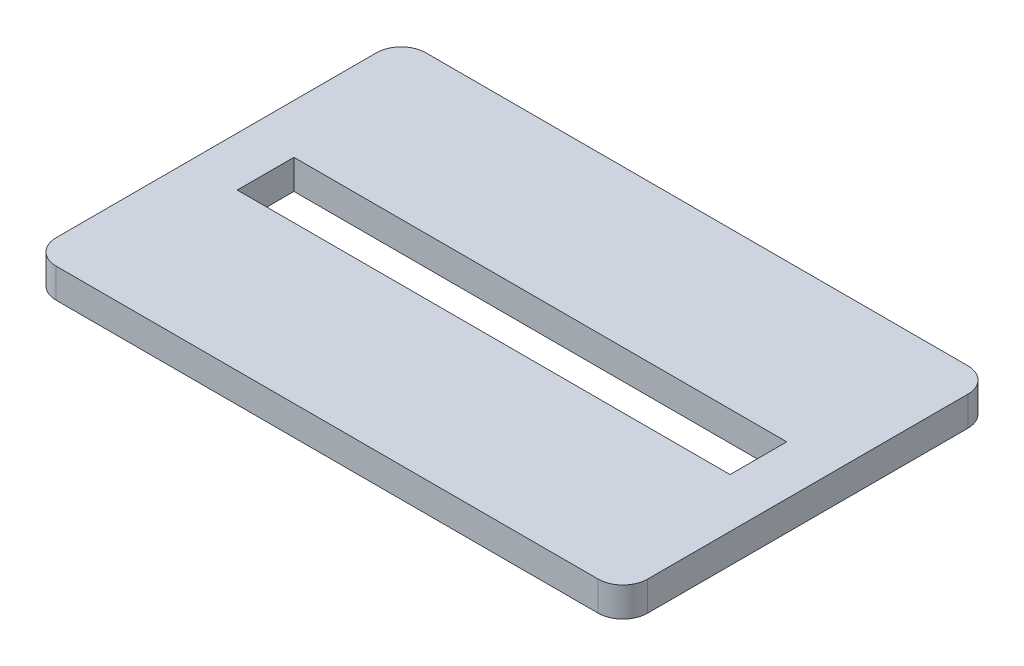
ISO-10303-21;
HEADER;
FILE_DESCRIPTION(('STEP AP214'),'2;1');
FILE_NAME('part.step','',(''),(''),'','','');
FILE_SCHEMA(('AUTOMOTIVE_DESIGN { 1 0 10303 214 1 1 1 1 }'));
ENDSEC;
DATA;
#1=APPLICATION_CONTEXT('core data for automotive mechanical design processes');
#2=APPLICATION_PROTOCOL_DEFINITION('international standard','automotive_design',2000,#1);
#3=PRODUCT_CONTEXT('',#1,'mechanical');
#4=PRODUCT('Part','Part','',(#3));
#5=PRODUCT_RELATED_PRODUCT_CATEGORY('part','',(#4));
#6=PRODUCT_DEFINITION_FORMATION('','',#4);
#7=PRODUCT_DEFINITION_CONTEXT('part definition',#1,'design');
#8=PRODUCT_DEFINITION('design','',#6,#7);
#9=PRODUCT_DEFINITION_SHAPE('','',#8);
#10=(LENGTH_UNIT() NAMED_UNIT(*) SI_UNIT(.MILLI.,.METRE.));
#11=(NAMED_UNIT(*) PLANE_ANGLE_UNIT() SI_UNIT($,.RADIAN.));
#12=(NAMED_UNIT(*) SI_UNIT($,.STERADIAN.) SOLID_ANGLE_UNIT());
#13=UNCERTAINTY_MEASURE_WITH_UNIT(LENGTH_MEASURE(1.E-05),#10,'distance_accuracy_value','');
#14=(GEOMETRIC_REPRESENTATION_CONTEXT(3) GLOBAL_UNCERTAINTY_ASSIGNED_CONTEXT((#13)) GLOBAL_UNIT_ASSIGNED_CONTEXT((#10,
#11,#12)) REPRESENTATION_CONTEXT('',''));
#15=CARTESIAN_POINT('',(0.,0.,0.));
#16=DIRECTION('',(0.,0.,1.));
#17=DIRECTION('',(1.,0.,0.));
#18=AXIS2_PLACEMENT_3D('',#15,#16,#17);
#19=CARTESIAN_POINT('',(0.,6.,0.));
#20=DIRECTION('',(0.,1.,0.));
#21=DIRECTION('',(0.,0.,1.));
#22=AXIS2_PLACEMENT_3D('',#19,#20,#21);
#23=PLANE('',#22);
#24=DIRECTION('',(-1.,0.,0.));
#25=VECTOR('',#24,1.);
#26=CARTESIAN_POINT('',(-60.,6.,-37.5));
#27=LINE('',#26,#25);
#28=CARTESIAN_POINT('',(55.,6.,-37.5));
#29=VERTEX_POINT('',#28);
#30=CARTESIAN_POINT('',(-55.,6.,-37.5));
#31=VERTEX_POINT('',#30);
#32=EDGE_CURVE('E191',#29,#31,#27,.T.);
#33=ORIENTED_EDGE('',*,*,#32,.T.);
#34=CARTESIAN_POINT('',(-55.,6.,-32.5));
#35=DIRECTION('',(0.,1.,0.));
#36=DIRECTION('',(0.,0.,1.));
#37=AXIS2_PLACEMENT_3D('',#34,#35,#36);
#38=CIRCLE('',#37,5.);
#39=CARTESIAN_POINT('',(-60.,6.,-32.5));
#40=VERTEX_POINT('',#39);
#41=EDGE_CURVE('E249',#31,#40,#38,.T.);
#42=ORIENTED_EDGE('',*,*,#41,.T.);
#43=DIRECTION('',(0.,0.,1.));
#44=VECTOR('',#43,1.);
#45=CARTESIAN_POINT('',(-60.,6.,-37.5));
#46=LINE('',#45,#44);
#47=CARTESIAN_POINT('',(-60.,6.,32.5));
#48=VERTEX_POINT('',#47);
#49=EDGE_CURVE('E196',#40,#48,#46,.T.);
#50=ORIENTED_EDGE('',*,*,#49,.T.);
#51=CARTESIAN_POINT('',(-55.,6.,32.5));
#52=DIRECTION('',(0.,1.,0.));
#53=DIRECTION('',(0.,0.,1.));
#54=AXIS2_PLACEMENT_3D('',#51,#52,#53);
#55=CIRCLE('',#54,5.);
#56=CARTESIAN_POINT('',(-55.,6.,37.5));
#57=VERTEX_POINT('',#56);
#58=EDGE_CURVE('E64',#48,#57,#55,.T.);
#59=ORIENTED_EDGE('',*,*,#58,.T.);
#60=DIRECTION('',(1.,0.,0.));
#61=VECTOR('',#60,1.);
#62=CARTESIAN_POINT('',(-60.,6.,37.5));
#63=LINE('',#62,#61);
#64=CARTESIAN_POINT('',(55.,6.,37.5));
#65=VERTEX_POINT('',#64);
#66=EDGE_CURVE('E199',#57,#65,#63,.T.);
#67=ORIENTED_EDGE('',*,*,#66,.T.);
#68=CARTESIAN_POINT('',(55.,6.,32.5));
#69=DIRECTION('',(0.,1.,0.));
#70=DIRECTION('',(0.,0.,1.));
#71=AXIS2_PLACEMENT_3D('',#68,#69,#70);
#72=CIRCLE('',#71,5.);
#73=CARTESIAN_POINT('',(60.,6.,32.5));
#74=VERTEX_POINT('',#73);
#75=EDGE_CURVE('E243',#65,#74,#72,.T.);
#76=ORIENTED_EDGE('',*,*,#75,.T.);
#77=DIRECTION('',(0.,0.,-1.));
#78=VECTOR('',#77,1.);
#79=CARTESIAN_POINT('',(60.,6.,-37.5));
#80=LINE('',#79,#78);
#81=CARTESIAN_POINT('',(60.,6.,-32.5));
#82=VERTEX_POINT('',#81);
#83=EDGE_CURVE('E187',#74,#82,#80,.T.);
#84=ORIENTED_EDGE('',*,*,#83,.T.);
#85=CARTESIAN_POINT('',(55.,6.,-32.5));
#86=DIRECTION('',(0.,1.,0.));
#87=DIRECTION('',(0.,0.,1.));
#88=AXIS2_PLACEMENT_3D('',#85,#86,#87);
#89=CIRCLE('',#88,5.);
#90=EDGE_CURVE('E246',#82,#29,#89,.T.);
#91=ORIENTED_EDGE('',*,*,#90,.T.);
#92=EDGE_LOOP('',(#33,#42,#50,#59,#67,#76,#84,#91));
#93=FACE_BOUND('',#92,.T.);
#94=DIRECTION('',(-1.,0.,0.));
#95=VECTOR('',#94,1.);
#96=CARTESIAN_POINT('',(-50.,6.,-5.75000000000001));
#97=LINE('',#96,#95);
#98=CARTESIAN_POINT('',(50.,6.,-5.75000000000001));
#99=VERTEX_POINT('',#98);
#100=CARTESIAN_POINT('',(-50.,6.,-5.75000000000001));
#101=VERTEX_POINT('',#100);
#102=EDGE_CURVE('E145',#99,#101,#97,.T.);
#103=ORIENTED_EDGE('',*,*,#102,.F.);
#104=DIRECTION('',(0.,0.,-1.));
#105=VECTOR('',#104,1.);
#106=CARTESIAN_POINT('',(50.,6.,-5.75000000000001));
#107=LINE('',#106,#105);
#108=CARTESIAN_POINT('',(50.,6.,5.74999999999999));
#109=VERTEX_POINT('',#108);
#110=EDGE_CURVE('E134',#109,#99,#107,.T.);
#111=ORIENTED_EDGE('',*,*,#110,.F.);
#112=DIRECTION('',(1.,0.,0.));
#113=VECTOR('',#112,1.);
#114=CARTESIAN_POINT('',(-50.,6.,5.74999999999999));
#115=LINE('',#114,#113);
#116=CARTESIAN_POINT('',(-50.,6.,5.74999999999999));
#117=VERTEX_POINT('',#116);
#118=EDGE_CURVE('E163',#117,#109,#115,.T.);
#119=ORIENTED_EDGE('',*,*,#118,.F.);
#120=DIRECTION('',(0.,0.,1.));
#121=VECTOR('',#120,1.);
#122=CARTESIAN_POINT('',(-50.,6.,-5.75000000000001));
#123=LINE('',#122,#121);
#124=EDGE_CURVE('E159',#101,#117,#123,.T.);
#125=ORIENTED_EDGE('',*,*,#124,.F.);
#126=EDGE_LOOP('',(#103,#111,#119,#125));
#127=FACE_BOUND('',#126,.T.);
#128=ADVANCED_FACE('F43',(#93,#127),#23,.T.);
#129=CARTESIAN_POINT('',(0.,0.,0.));
#130=DIRECTION('',(0.,1.,0.));
#131=DIRECTION('',(0.,0.,1.));
#132=AXIS2_PLACEMENT_3D('',#129,#130,#131);
#133=PLANE('',#132);
#134=DIRECTION('',(0.,0.,1.));
#135=VECTOR('',#134,1.);
#136=CARTESIAN_POINT('',(-60.,0.,-37.5));
#137=LINE('',#136,#135);
#138=CARTESIAN_POINT('',(-60.,0.,-32.5));
#139=VERTEX_POINT('',#138);
#140=CARTESIAN_POINT('',(-60.,0.,32.5));
#141=VERTEX_POINT('',#140);
#142=EDGE_CURVE('E210',#139,#141,#137,.T.);
#143=ORIENTED_EDGE('',*,*,#142,.F.);
#144=CARTESIAN_POINT('',(-55.,0.,-32.5));
#145=DIRECTION('',(0.,1.,0.));
#146=DIRECTION('',(0.,0.,1.));
#147=AXIS2_PLACEMENT_3D('',#144,#145,#146);
#148=CIRCLE('',#147,5.);
#149=CARTESIAN_POINT('',(-55.,0.,-37.5));
#150=VERTEX_POINT('',#149);
#151=EDGE_CURVE('E231',#139,#150,#148,.F.);
#152=ORIENTED_EDGE('',*,*,#151,.T.);
#153=DIRECTION('',(-1.,0.,0.));
#154=VECTOR('',#153,1.);
#155=CARTESIAN_POINT('',(-60.,0.,-37.5));
#156=LINE('',#155,#154);
#157=CARTESIAN_POINT('',(55.,0.,-37.5));
#158=VERTEX_POINT('',#157);
#159=EDGE_CURVE('E206',#158,#150,#156,.T.);
#160=ORIENTED_EDGE('',*,*,#159,.F.);
#161=CARTESIAN_POINT('',(55.,0.,-32.5));
#162=DIRECTION('',(0.,1.,0.));
#163=DIRECTION('',(0.,0.,1.));
#164=AXIS2_PLACEMENT_3D('',#161,#162,#163);
#165=CIRCLE('',#164,5.);
#166=CARTESIAN_POINT('',(60.,0.,-32.5));
#167=VERTEX_POINT('',#166);
#168=EDGE_CURVE('E228',#158,#167,#165,.F.);
#169=ORIENTED_EDGE('',*,*,#168,.T.);
#170=DIRECTION('',(0.,0.,-1.));
#171=VECTOR('',#170,1.);
#172=CARTESIAN_POINT('',(60.,0.,-37.5));
#173=LINE('',#172,#171);
#174=CARTESIAN_POINT('',(60.,0.,32.5));
#175=VERTEX_POINT('',#174);
#176=EDGE_CURVE('E154',#175,#167,#173,.T.);
#177=ORIENTED_EDGE('',*,*,#176,.F.);
#178=CARTESIAN_POINT('',(55.,0.,32.5));
#179=DIRECTION('',(0.,1.,0.));
#180=DIRECTION('',(0.,0.,1.));
#181=AXIS2_PLACEMENT_3D('',#178,#179,#180);
#182=CIRCLE('',#181,5.);
#183=CARTESIAN_POINT('',(55.,0.,37.5));
#184=VERTEX_POINT('',#183);
#185=EDGE_CURVE('E225',#175,#184,#182,.F.);
#186=ORIENTED_EDGE('',*,*,#185,.T.);
#187=DIRECTION('',(1.,0.,0.));
#188=VECTOR('',#187,1.);
#189=CARTESIAN_POINT('',(-60.,0.,37.5));
#190=LINE('',#189,#188);
#191=CARTESIAN_POINT('',(-55.,0.,37.5));
#192=VERTEX_POINT('',#191);
#193=EDGE_CURVE('E192',#192,#184,#190,.T.);
#194=ORIENTED_EDGE('',*,*,#193,.F.);
#195=CARTESIAN_POINT('',(-55.,0.,32.5));
#196=DIRECTION('',(0.,1.,0.));
#197=DIRECTION('',(0.,0.,1.));
#198=AXIS2_PLACEMENT_3D('',#195,#196,#197);
#199=CIRCLE('',#198,5.);
#200=EDGE_CURVE('E222',#192,#141,#199,.F.);
#201=ORIENTED_EDGE('',*,*,#200,.T.);
#202=EDGE_LOOP('',(#143,#152,#160,#169,#177,#186,#194,#201));
#203=FACE_BOUND('',#202,.T.);
#204=DIRECTION('',(0.,0.,-1.));
#205=VECTOR('',#204,1.);
#206=CARTESIAN_POINT('',(50.,0.,-5.75000000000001));
#207=LINE('',#206,#205);
#208=CARTESIAN_POINT('',(50.,0.,5.74999999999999));
#209=VERTEX_POINT('',#208);
#210=CARTESIAN_POINT('',(50.,0.,-5.75000000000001));
#211=VERTEX_POINT('',#210);
#212=EDGE_CURVE('E168',#209,#211,#207,.T.);
#213=ORIENTED_EDGE('',*,*,#212,.T.);
#214=DIRECTION('',(-1.,0.,0.));
#215=VECTOR('',#214,1.);
#216=CARTESIAN_POINT('',(-50.,0.,-5.75000000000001));
#217=LINE('',#216,#215);
#218=CARTESIAN_POINT('',(-50.,0.,-5.75000000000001));
#219=VERTEX_POINT('',#218);
#220=EDGE_CURVE('E152',#211,#219,#217,.T.);
#221=ORIENTED_EDGE('',*,*,#220,.T.);
#222=DIRECTION('',(0.,0.,1.));
#223=VECTOR('',#222,1.);
#224=CARTESIAN_POINT('',(-50.,0.,-5.75000000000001));
#225=LINE('',#224,#223);
#226=CARTESIAN_POINT('',(-50.,0.,5.74999999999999));
#227=VERTEX_POINT('',#226);
#228=EDGE_CURVE('E173',#219,#227,#225,.T.);
#229=ORIENTED_EDGE('',*,*,#228,.T.);
#230=DIRECTION('',(1.,0.,0.));
#231=VECTOR('',#230,1.);
#232=CARTESIAN_POINT('',(-50.,0.,5.74999999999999));
#233=LINE('',#232,#231);
#234=EDGE_CURVE('E146',#227,#209,#233,.T.);
#235=ORIENTED_EDGE('',*,*,#234,.T.);
#236=EDGE_LOOP('',(#213,#221,#229,#235));
#237=FACE_BOUND('',#236,.T.);
#238=ADVANCED_FACE('F266',(#203,#237),#133,.F.);
#239=CARTESIAN_POINT('',(60.,6.,-37.5));
#240=DIRECTION('',(-1.,0.,0.));
#241=DIRECTION('',(0.,0.,1.));
#242=AXIS2_PLACEMENT_3D('',#239,#240,#241);
#243=PLANE('',#242);
#244=ORIENTED_EDGE('',*,*,#176,.T.);
#245=DIRECTION('',(0.,-1.,0.));
#246=VECTOR('',#245,1.);
#247=CARTESIAN_POINT('',(60.,6.,-32.5));
#248=LINE('',#247,#246);
#249=EDGE_CURVE('E256',#167,#82,#248,.F.);
#250=ORIENTED_EDGE('',*,*,#249,.T.);
#251=ORIENTED_EDGE('',*,*,#83,.F.);
#252=DIRECTION('',(0.,-1.,0.));
#253=VECTOR('',#252,1.);
#254=CARTESIAN_POINT('',(60.,6.,32.5));
#255=LINE('',#254,#253);
#256=EDGE_CURVE('E252',#74,#175,#255,.T.);
#257=ORIENTED_EDGE('',*,*,#256,.T.);
#258=EDGE_LOOP('',(#244,#250,#251,#257));
#259=FACE_BOUND('',#258,.T.);
#260=ADVANCED_FACE('F275',(#259),#243,.F.);
#261=CARTESIAN_POINT('',(-60.,6.,-37.5));
#262=DIRECTION('',(0.,0.,1.));
#263=DIRECTION('',(1.,0.,0.));
#264=AXIS2_PLACEMENT_3D('',#261,#262,#263);
#265=PLANE('',#264);
#266=ORIENTED_EDGE('',*,*,#159,.T.);
#267=DIRECTION('',(0.,-1.,0.));
#268=VECTOR('',#267,1.);
#269=CARTESIAN_POINT('',(-55.,6.,-37.5));
#270=LINE('',#269,#268);
#271=EDGE_CURVE('E238',#150,#31,#270,.F.);
#272=ORIENTED_EDGE('',*,*,#271,.T.);
#273=ORIENTED_EDGE('',*,*,#32,.F.);
#274=DIRECTION('',(0.,-1.,0.));
#275=VECTOR('',#274,1.);
#276=CARTESIAN_POINT('',(55.,6.,-37.5));
#277=LINE('',#276,#275);
#278=EDGE_CURVE('E234',#29,#158,#277,.T.);
#279=ORIENTED_EDGE('',*,*,#278,.T.);
#280=EDGE_LOOP('',(#266,#272,#273,#279));
#281=FACE_BOUND('',#280,.T.);
#282=ADVANCED_FACE('F284',(#281),#265,.F.);
#283=CARTESIAN_POINT('',(-60.,6.,-37.5));
#284=DIRECTION('',(1.,0.,0.));
#285=DIRECTION('',(0.,0.,-1.));
#286=AXIS2_PLACEMENT_3D('',#283,#284,#285);
#287=PLANE('',#286);
#288=ORIENTED_EDGE('',*,*,#49,.F.);
#289=DIRECTION('',(0.,-1.,0.));
#290=VECTOR('',#289,1.);
#291=CARTESIAN_POINT('',(-60.,6.,-32.5));
#292=LINE('',#291,#290);
#293=EDGE_CURVE('E218',#40,#139,#292,.T.);
#294=ORIENTED_EDGE('',*,*,#293,.T.);
#295=ORIENTED_EDGE('',*,*,#142,.T.);
#296=DIRECTION('',(0.,-1.,0.));
#297=VECTOR('',#296,1.);
#298=CARTESIAN_POINT('',(-60.,6.,32.5));
#299=LINE('',#298,#297);
#300=EDGE_CURVE('E202',#141,#48,#299,.F.);
#301=ORIENTED_EDGE('',*,*,#300,.T.);
#302=EDGE_LOOP('',(#288,#294,#295,#301));
#303=FACE_BOUND('',#302,.T.);
#304=ADVANCED_FACE('F292',(#303),#287,.F.);
#305=CARTESIAN_POINT('',(-60.,6.,37.5));
#306=DIRECTION('',(0.,0.,-1.));
#307=DIRECTION('',(-1.,0.,0.));
#308=AXIS2_PLACEMENT_3D('',#305,#306,#307);
#309=PLANE('',#308);
#310=ORIENTED_EDGE('',*,*,#193,.T.);
#311=DIRECTION('',(0.,-1.,0.));
#312=VECTOR('',#311,1.);
#313=CARTESIAN_POINT('',(55.,6.,37.5));
#314=LINE('',#313,#312);
#315=EDGE_CURVE('E11',#184,#65,#314,.F.);
#316=ORIENTED_EDGE('',*,*,#315,.T.);
#317=ORIENTED_EDGE('',*,*,#66,.F.);
#318=DIRECTION('',(0.,-1.,0.));
#319=VECTOR('',#318,1.);
#320=CARTESIAN_POINT('',(-55.,6.,37.5));
#321=LINE('',#320,#319);
#322=EDGE_CURVE('E52',#57,#192,#321,.T.);
#323=ORIENTED_EDGE('',*,*,#322,.T.);
#324=EDGE_LOOP('',(#310,#316,#317,#323));
#325=FACE_BOUND('',#324,.T.);
#326=ADVANCED_FACE('F262',(#325),#309,.F.);
#327=CARTESIAN_POINT('',(50.,6.,-5.75000000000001));
#328=DIRECTION('',(-1.,0.,0.));
#329=DIRECTION('',(0.,0.,1.));
#330=AXIS2_PLACEMENT_3D('',#327,#328,#329);
#331=PLANE('',#330);
#332=ORIENTED_EDGE('',*,*,#212,.F.);
#333=DIRECTION('',(0.,-1.,0.));
#334=VECTOR('',#333,1.);
#335=CARTESIAN_POINT('',(50.,6.,5.74999999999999));
#336=LINE('',#335,#334);
#337=EDGE_CURVE('E140',#109,#209,#336,.T.);
#338=ORIENTED_EDGE('',*,*,#337,.F.);
#339=ORIENTED_EDGE('',*,*,#110,.T.);
#340=DIRECTION('',(0.,-1.,0.));
#341=VECTOR('',#340,1.);
#342=CARTESIAN_POINT('',(50.,6.,-5.75000000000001));
#343=LINE('',#342,#341);
#344=EDGE_CURVE('E137',#99,#211,#343,.T.);
#345=ORIENTED_EDGE('',*,*,#344,.T.);
#346=EDGE_LOOP('',(#332,#338,#339,#345));
#347=FACE_BOUND('',#346,.T.);
#348=ADVANCED_FACE('F136',(#347),#331,.T.);
#349=CARTESIAN_POINT('',(-50.,6.,-5.75000000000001));
#350=DIRECTION('',(0.,0.,1.));
#351=DIRECTION('',(1.,0.,0.));
#352=AXIS2_PLACEMENT_3D('',#349,#350,#351);
#353=PLANE('',#352);
#354=ORIENTED_EDGE('',*,*,#220,.F.);
#355=ORIENTED_EDGE('',*,*,#344,.F.);
#356=ORIENTED_EDGE('',*,*,#102,.T.);
#357=DIRECTION('',(0.,-1.,0.));
#358=VECTOR('',#357,1.);
#359=CARTESIAN_POINT('',(-50.,6.,-5.75000000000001));
#360=LINE('',#359,#358);
#361=EDGE_CURVE('E155',#101,#219,#360,.T.);
#362=ORIENTED_EDGE('',*,*,#361,.T.);
#363=EDGE_LOOP('',(#354,#355,#356,#362));
#364=FACE_BOUND('',#363,.T.);
#365=ADVANCED_FACE('F149',(#364),#353,.T.);
#366=CARTESIAN_POINT('',(-50.,6.,-5.75000000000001));
#367=DIRECTION('',(1.,0.,0.));
#368=DIRECTION('',(0.,0.,-1.));
#369=AXIS2_PLACEMENT_3D('',#366,#367,#368);
#370=PLANE('',#369);
#371=ORIENTED_EDGE('',*,*,#228,.F.);
#372=ORIENTED_EDGE('',*,*,#361,.F.);
#373=ORIENTED_EDGE('',*,*,#124,.T.);
#374=DIRECTION('',(0.,-1.,0.));
#375=VECTOR('',#374,1.);
#376=CARTESIAN_POINT('',(-50.,6.,5.74999999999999));
#377=LINE('',#376,#375);
#378=EDGE_CURVE('E182',#117,#227,#377,.T.);
#379=ORIENTED_EDGE('',*,*,#378,.T.);
#380=EDGE_LOOP('',(#371,#372,#373,#379));
#381=FACE_BOUND('',#380,.T.);
#382=ADVANCED_FACE('F353',(#381),#370,.T.);
#383=CARTESIAN_POINT('',(-50.,6.,5.74999999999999));
#384=DIRECTION('',(0.,0.,-1.));
#385=DIRECTION('',(-1.,0.,0.));
#386=AXIS2_PLACEMENT_3D('',#383,#384,#385);
#387=PLANE('',#386);
#388=ORIENTED_EDGE('',*,*,#234,.F.);
#389=ORIENTED_EDGE('',*,*,#378,.F.);
#390=ORIENTED_EDGE('',*,*,#118,.T.);
#391=ORIENTED_EDGE('',*,*,#337,.T.);
#392=EDGE_LOOP('',(#388,#389,#390,#391));
#393=FACE_BOUND('',#392,.T.);
#394=ADVANCED_FACE('F317',(#393),#387,.T.);
#395=CARTESIAN_POINT('',(-55.,6.,-32.5));
#396=DIRECTION('',(0.,-1.,0.));
#397=DIRECTION('',(0.,0.,-1.));
#398=AXIS2_PLACEMENT_3D('',#395,#396,#397);
#399=CYLINDRICAL_SURFACE('',#398,5.);
#400=ORIENTED_EDGE('',*,*,#41,.F.);
#401=ORIENTED_EDGE('',*,*,#271,.F.);
#402=ORIENTED_EDGE('',*,*,#151,.F.);
#403=ORIENTED_EDGE('',*,*,#293,.F.);
#404=EDGE_LOOP('',(#400,#401,#402,#403));
#405=FACE_BOUND('',#404,.T.);
#406=ADVANCED_FACE('F289',(#405),#399,.T.);
#407=CARTESIAN_POINT('',(55.,6.,-32.5));
#408=DIRECTION('',(0.,-1.,0.));
#409=DIRECTION('',(0.,0.,-1.));
#410=AXIS2_PLACEMENT_3D('',#407,#408,#409);
#411=CYLINDRICAL_SURFACE('',#410,5.);
#412=ORIENTED_EDGE('',*,*,#90,.F.);
#413=ORIENTED_EDGE('',*,*,#249,.F.);
#414=ORIENTED_EDGE('',*,*,#168,.F.);
#415=ORIENTED_EDGE('',*,*,#278,.F.);
#416=EDGE_LOOP('',(#412,#413,#414,#415));
#417=FACE_BOUND('',#416,.T.);
#418=ADVANCED_FACE('F281',(#417),#411,.T.);
#419=CARTESIAN_POINT('',(55.,6.,32.5));
#420=DIRECTION('',(0.,-1.,0.));
#421=DIRECTION('',(0.,0.,-1.));
#422=AXIS2_PLACEMENT_3D('',#419,#420,#421);
#423=CYLINDRICAL_SURFACE('',#422,5.);
#424=ORIENTED_EDGE('',*,*,#75,.F.);
#425=ORIENTED_EDGE('',*,*,#315,.F.);
#426=ORIENTED_EDGE('',*,*,#185,.F.);
#427=ORIENTED_EDGE('',*,*,#256,.F.);
#428=EDGE_LOOP('',(#424,#425,#426,#427));
#429=FACE_BOUND('',#428,.T.);
#430=ADVANCED_FACE('F272',(#429),#423,.T.);
#431=CARTESIAN_POINT('',(-55.,6.,32.5));
#432=DIRECTION('',(0.,-1.,0.));
#433=DIRECTION('',(0.,0.,-1.));
#434=AXIS2_PLACEMENT_3D('',#431,#432,#433);
#435=CYLINDRICAL_SURFACE('',#434,5.);
#436=ORIENTED_EDGE('',*,*,#58,.F.);
#437=ORIENTED_EDGE('',*,*,#300,.F.);
#438=ORIENTED_EDGE('',*,*,#200,.F.);
#439=ORIENTED_EDGE('',*,*,#322,.F.);
#440=EDGE_LOOP('',(#436,#437,#438,#439));
#441=FACE_BOUND('',#440,.T.);
#442=ADVANCED_FACE('F45',(#441),#435,.T.);
#443=CLOSED_SHELL('',(#128,#238,#260,#282,#304,#326,#348,#365,#382,#394,#406,#418,#430,#442));
#444=MANIFOLD_SOLID_BREP('B2',#443);
#445=ADVANCED_BREP_SHAPE_REPRESENTATION('',(#18,#444),#14);
#446=SHAPE_DEFINITION_REPRESENTATION(#9,#445);
ENDSEC;
END-ISO-10303-21;
